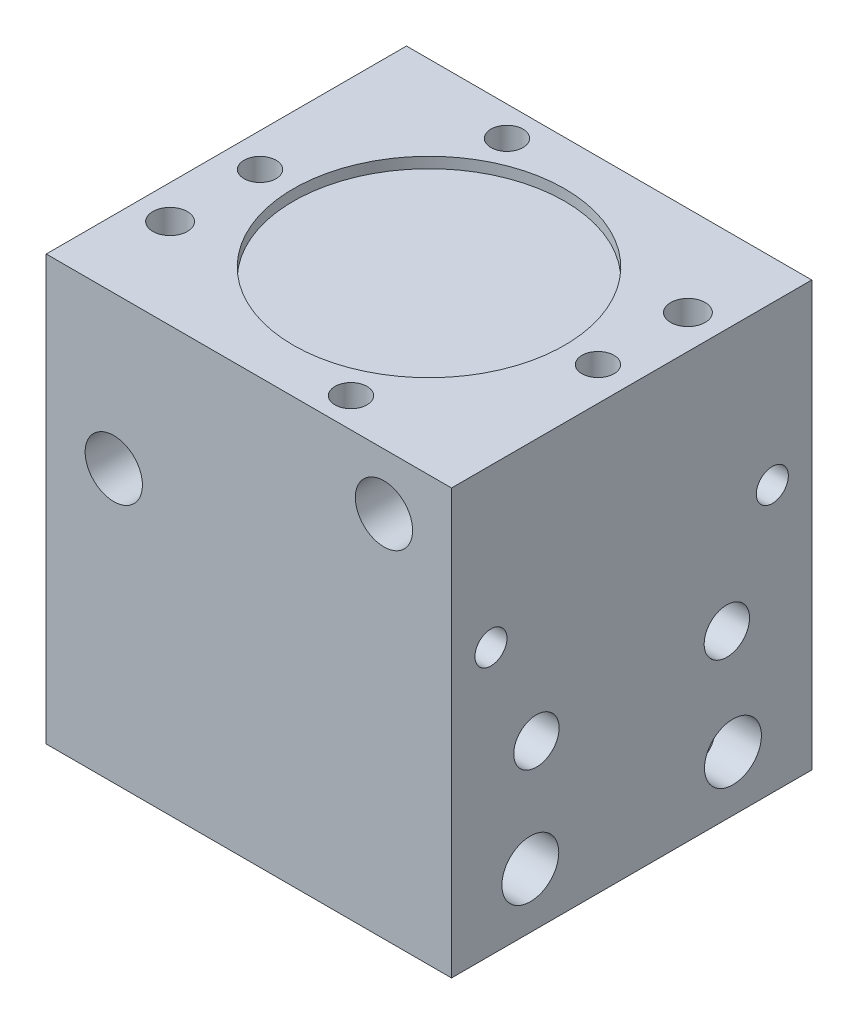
from build123d import *

# Parameters (mm, degrees)
SKETCH1_W                            = 28.575
SKETCH1_H                            = 25.4
EXTRUDE1_DEPTH                       = 14.9606
CUT_EXTRUDE1_DEPTH                   = 14.0462
SKETCH3_R                            = 9.5631
CUT_EXTRUDE2_DEPTH                   = 0.762
SKETCH4_R                            = 1.6002
SKETCH4_R_2                          = 2.0066
CUT_EXTRUDE3_DEPTH                   = 35.664681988
F_4_40_SENSOR_BLOCK_MOUNT_D          = 2.2606
F_4_40_SENSOR_BLOCK_MOUNT_DEPTH      = 11.0998
F_4_40_SENSOR_BLOCK_MOUNT_TIP        = 0.679152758
F_4_40_TAPPED_HOLE3_D                = 2.2606
F_4_40_TAPPED_HOLE3_DEPTH            = 9.525
F_4_40_TAPPED_HOLE3_TIP              = 0.679152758
SKETCH13_R                           = 1.22555
F_3_32_DOWEL_HOLES_SLIP_FIT_DEPTH    = 3.175
F_4_40_MOUNT_HOLES_D                 = 2.2606
F_4_40_MOUNT_HOLES_DEPTH             = 14.3002
F_4_40_MOUNT_HOLES_TIP               = 0.679152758
SKETCH16_R                           = 1.2192
F_3_32_DOWEL_HOLES_SLIP_FIT_2_DEPTH  = 6.35
F_10_32_TAPPED_HOLE1_AIR_PORTS_D     = 4.0386
F_10_32_TAPPED_HOLE1_AIR_PORTS_DEPTH = 8.0264
F_10_32_TAPPED_HOLE1_AIR_PORTS_TIP   = 1.213317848


with BuildPart() as part:
    # Sketch1 → Extrude1 (new, symmetric)
    with BuildSketch(Plane(origin=(0, 0, 0), x_dir=(1, 0, 0), z_dir=(0, 1, 0))):
        Rectangle(SKETCH1_W, SKETCH1_H)
    extrude(amount=EXTRUDE1_DEPTH, both=True)

    # Sketch2 → Cut-Extrude1 (cut)
    with BuildSketch(Plane.XZ.offset(14.9606)):
        with BuildLine():
            Line((-11.1252, 6.183063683), (-11.1252, -6.183063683))
            ThreePointArc((-11.1252, -6.183063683), (-11.419039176, -8.704904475), (-9.271, -10.0584))
            Line((-9.271, -10.0584), (9.271, -10.0584))
            ThreePointArc((9.271, -10.0584), (11.419039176, -8.704904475), (11.1252, -6.183063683))
            Line((11.1252, -6.183063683), (11.1252, 6.183063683))
            ThreePointArc((11.1252, 6.183063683), (11.419039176, 8.704904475), (9.271, 10.0584))
            Line((9.271, 10.0584), (-9.271, 10.0584))
            ThreePointArc((-9.271, 10.0584), (-11.419039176, 8.704904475), (-11.1252, 6.183063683))
        make_face()
    extrude(amount=-CUT_EXTRUDE1_DEPTH, mode=Mode.SUBTRACT)

    # Sketch3 → Cut-Extrude2 (cut)
    with BuildSketch(Plane(origin=(0, 14.9606, 0), x_dir=(-1, 0, 0), z_dir=(0, 1, 0))):
        with Locations(Location((0, 0, 0), (0, 0, 90))):
            Circle(SKETCH3_R)
    extrude(amount=-CUT_EXTRUDE2_DEPTH, mode=Mode.SUBTRACT)

    # Sketch4 → Cut-Extrude3 (cut, through all)
    with BuildSketch(Plane(origin=(14.2875, 0, 0), x_dir=(0, 0, -1), z_dir=(1, 0, 0))):
        with Locations((-6.71322, -3.4798)):
            Circle(SKETCH4_R)
        with Locations((-7.14375, -11.0744)):
            Circle(SKETCH4_R_2)
        with Locations(Location((7.14375, -11.0744, 0), (0, 0, 118.604658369))):
            Circle(SKETCH4_R_2)
        with Locations(Location((6.71322, -3.4798, 0), (0, 0, 250.652039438))):
            Circle(SKETCH4_R)
    extrude(amount=-CUT_EXTRUDE3_DEPTH, mode=Mode.SUBTRACT)

    # 4-40 _Sensor Block Mount
    with Locations(Plane(origin=(14.2875, 0, 0), x_dir=(0, 0, -1), z_dir=(1, 0, 0))):
        with Locations((-9.9187, 3.8354), (9.9187, 3.8354)):
            Hole(F_4_40_SENSOR_BLOCK_MOUNT_D / 2, depth=F_4_40_SENSOR_BLOCK_MOUNT_DEPTH)
            with Locations((0, 0, -(F_4_40_SENSOR_BLOCK_MOUNT_DEPTH + F_4_40_SENSOR_BLOCK_MOUNT_TIP / 2))):  # 118° drill point
                Cone(0, F_4_40_SENSOR_BLOCK_MOUNT_D / 2, F_4_40_SENSOR_BLOCK_MOUNT_TIP, mode=Mode.SUBTRACT)

    # 4-40 Tapped Hole3
    with Locations(Plane(origin=(0, 0, -12.7), x_dir=(-1, 0, 0), z_dir=(0, 0, -1))):
        with Locations((-11.1125, 0.6731), (11.1125, 0.6731)):
            Hole(F_4_40_TAPPED_HOLE3_D / 2, depth=F_4_40_TAPPED_HOLE3_DEPTH)
            with Locations((0, 0, -(F_4_40_TAPPED_HOLE3_DEPTH + F_4_40_TAPPED_HOLE3_TIP / 2))):  # 118° drill point
                Cone(0, F_4_40_TAPPED_HOLE3_D / 2, F_4_40_TAPPED_HOLE3_TIP, mode=Mode.SUBTRACT)

    # Sketch13 → 3_32 Dowel Holes - Slip Fit (cut)
    with BuildSketch(Plane(origin=(0, 0, -12.7), x_dir=(-1, 0, 0), z_dir=(0, 0, -1))):
        with Locations((-11.1125, 10.1854)):
            Circle(SKETCH13_R)
        with Locations((11.1125, 10.1854)):
            Circle(SKETCH13_R)
    extrude(amount=-F_3_32_DOWEL_HOLES_SLIP_FIT_DEPTH, mode=Mode.SUBTRACT)

    # 4-40 _Mount Holes
    with Locations(Plane(origin=(0, 14.9606, 0), x_dir=(-1, 0, 0), z_dir=(0, 1, 0))):
        with Locations((5.1054, -10.6045), (11.9126, 0), (-5.1054, 10.6045), (-11.9126, 0)):
            Hole(F_4_40_MOUNT_HOLES_D / 2, depth=F_4_40_MOUNT_HOLES_DEPTH)
            with Locations((0, 0, -(F_4_40_MOUNT_HOLES_DEPTH + F_4_40_MOUNT_HOLES_TIP / 2))):  # 118° drill point
                Cone(0, F_4_40_MOUNT_HOLES_D / 2, F_4_40_MOUNT_HOLES_TIP, mode=Mode.SUBTRACT)

    # Sketch16 → 3_32 Dowel Holes - Slip Fit 2 (cut)
    with BuildSketch(Plane(origin=(0, 14.9606, 0), x_dir=(-1, 0, 0), z_dir=(0, 1, 0))):
        with Locations(Location((11.90625, 6.35, 0), (0, 0, 90))):
            Circle(SKETCH16_R)
        with Locations(Location((-11.90625, -6.35, 0), (0, 0, 90))):
            Circle(SKETCH16_R)
    extrude(amount=-F_3_32_DOWEL_HOLES_SLIP_FIT_2_DEPTH, mode=Mode.SUBTRACT)

    # 10-32 Tapped Hole1 _Air Ports
    with Locations(Plane.XY.offset(12.7)):
        with Locations((-9.525, 4.2418), (9.525, 10.9982)):
            Hole(F_10_32_TAPPED_HOLE1_AIR_PORTS_D / 2, depth=F_10_32_TAPPED_HOLE1_AIR_PORTS_DEPTH)
            with Locations((0, 0, -(F_10_32_TAPPED_HOLE1_AIR_PORTS_DEPTH + F_10_32_TAPPED_HOLE1_AIR_PORTS_TIP / 2))):  # 118° drill point
                Cone(0, F_10_32_TAPPED_HOLE1_AIR_PORTS_D / 2, F_10_32_TAPPED_HOLE1_AIR_PORTS_TIP, mode=Mode.SUBTRACT)


solid = part.part
